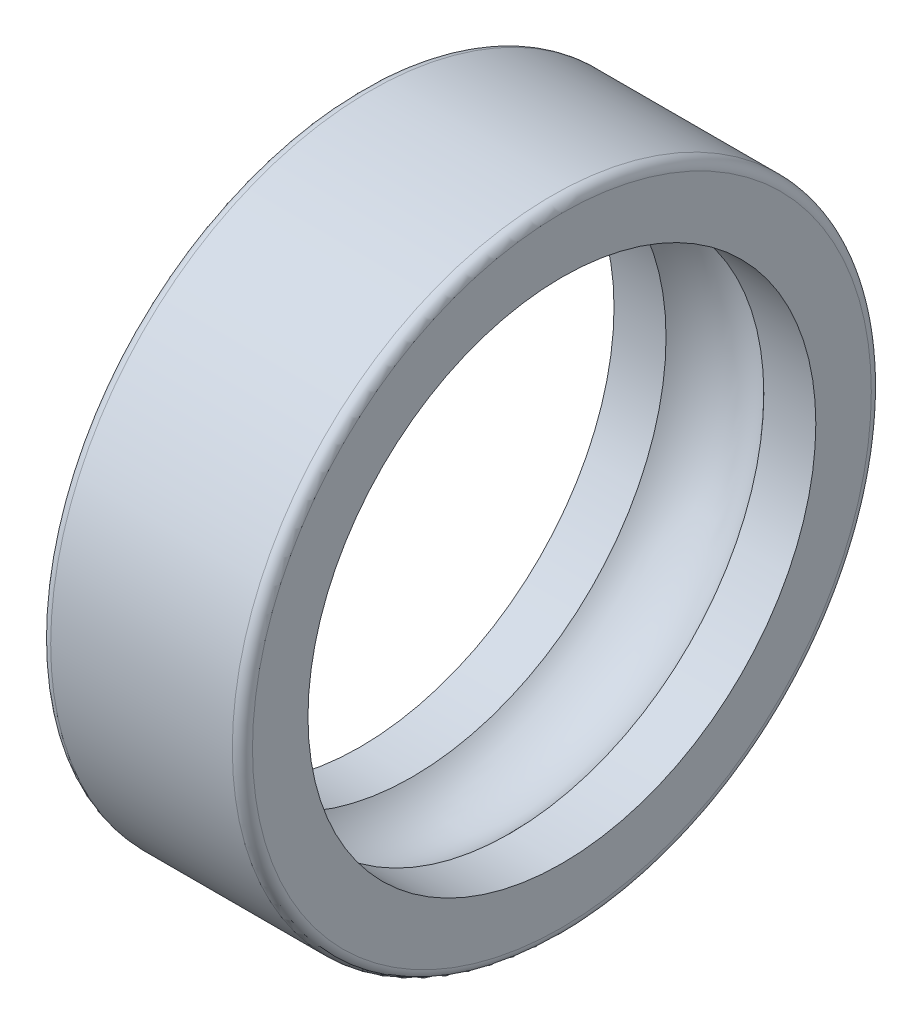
from build123d import *


with BuildPart() as part:
    # Esquisse1 → Base-R_volution (revolve)
    with BuildSketch(Plane(origin=(0, 0, 0), x_dir=(1, 0, 0), z_dir=(0, 1, 0)), mode=Mode.PRIVATE) as base_r_volution_sk:
        with BuildLine():
            Line((0, 9.2), (0, 7.55))
            Line((0, 7.55), (1.546555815, 7.55))
            ThreePointArc((1.546555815, 7.55), (3, 8.2), (4.453444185, 7.55))
            Line((4.453444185, 7.55), (6, 7.55))
            Line((6, 7.55), (6, 9.2))
            ThreePointArc((6, 9.2), (5.912132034, 9.412132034), (5.7, 9.5))
            Line((5.7, 9.5), (0.3, 9.5))
            ThreePointArc((0.3, 9.5), (0.087867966, 9.412132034), (0, 9.2))
        make_face()
    revolve(base_r_volution_sk.sketch.rotate(Axis((0, 0, 0), (1, 0, 0)), 180), axis=Axis((0, 0, 0), (1, 0, 0)))


solid = part.part
